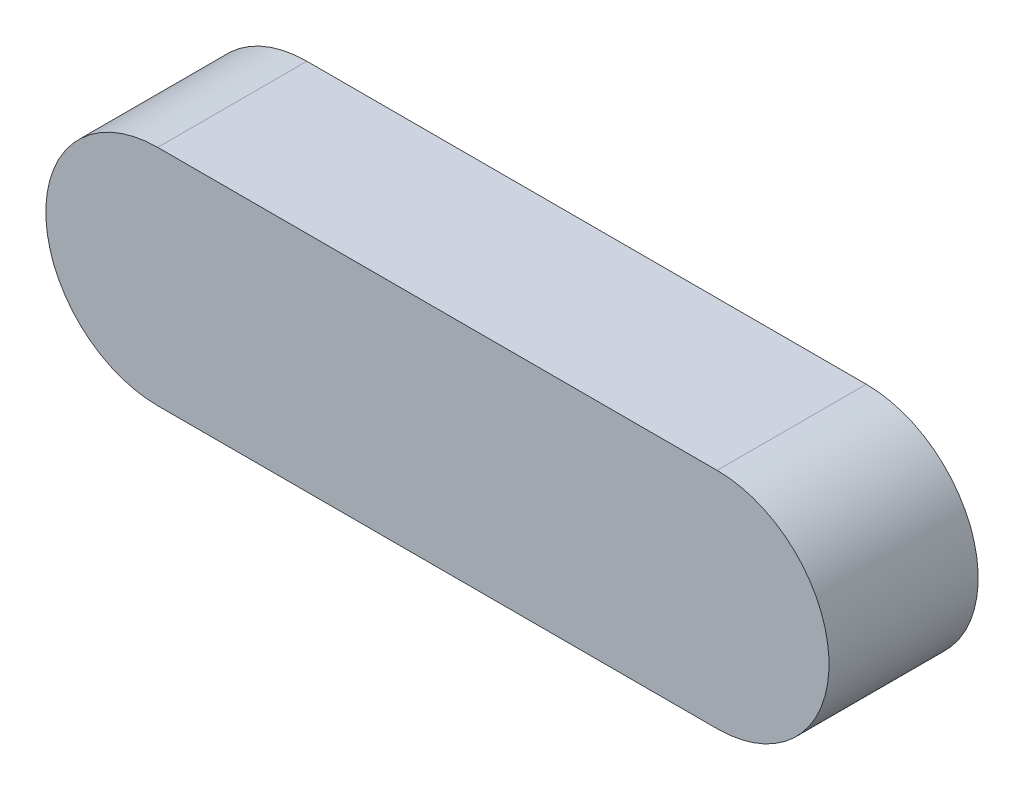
from build123d import *

# Parameters (mm, degrees)
BASE_EXTRUSION_DEPTH = 2


with BuildPart() as part:
    # Esquisse1 → Base-Extrusion (new body)
    with BuildSketch(Plane.XY):
        with BuildLine():
            Line((-7.5, 1.5), (0, 1.5))
            ThreePointArc((0, 1.5), (1.5, 0), (0, -1.5))
            Line((0, -1.5), (-7.5, -1.5))
            ThreePointArc((-7.5, -1.5), (-9, 0), (-7.5, 1.5))
        make_face()
    extrude(amount=BASE_EXTRUSION_DEPTH)


solid = part.part
